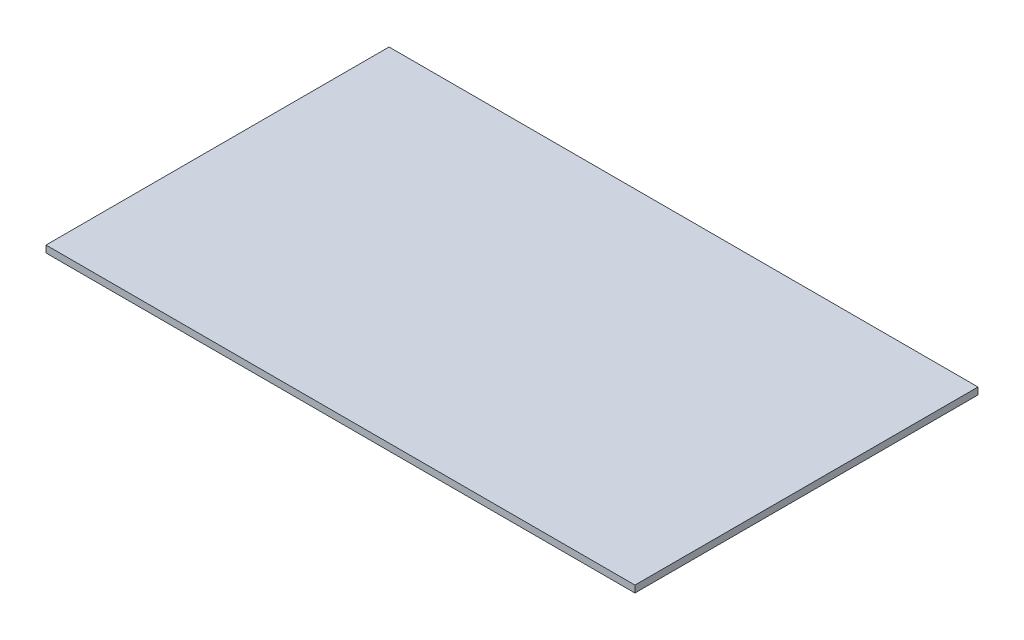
from build123d import *

# Parameters (mm, degrees)
SKETCH_1_W                     = 255.8
SKETCH_1_H                     = 3
V2_REF_CHASSIS_255P8X149_DEPTH = 149


with BuildPart() as part:
    # Sketch 1 → V2_REF_chassis_255p8x149 (new body)
    with BuildSketch(Plane.XY):
        with Locations((127.9, 1.5)):
            Rectangle(SKETCH_1_W, SKETCH_1_H)
    extrude(amount=V2_REF_CHASSIS_255P8X149_DEPTH)


solid = part.part
